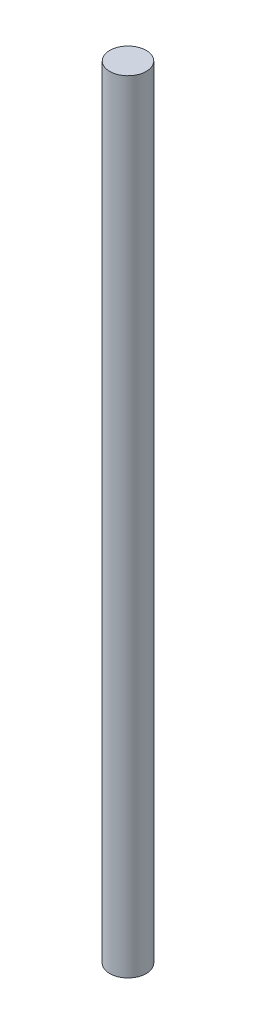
ISO-10303-21;
HEADER;
FILE_DESCRIPTION(('STEP AP214'),'2;1');
FILE_NAME('part.step','',(''),(''),'','','');
FILE_SCHEMA(('AUTOMOTIVE_DESIGN { 1 0 10303 214 1 1 1 1 }'));
ENDSEC;
DATA;
#1=APPLICATION_CONTEXT('core data for automotive mechanical design processes');
#2=APPLICATION_PROTOCOL_DEFINITION('international standard','automotive_design',2000,#1);
#3=PRODUCT_CONTEXT('',#1,'mechanical');
#4=PRODUCT('Part','Part','',(#3));
#5=PRODUCT_RELATED_PRODUCT_CATEGORY('part','',(#4));
#6=PRODUCT_DEFINITION_FORMATION('','',#4);
#7=PRODUCT_DEFINITION_CONTEXT('part definition',#1,'design');
#8=PRODUCT_DEFINITION('design','',#6,#7);
#9=PRODUCT_DEFINITION_SHAPE('','',#8);
#10=(LENGTH_UNIT() NAMED_UNIT(*) SI_UNIT(.MILLI.,.METRE.));
#11=(NAMED_UNIT(*) PLANE_ANGLE_UNIT() SI_UNIT($,.RADIAN.));
#12=(NAMED_UNIT(*) SI_UNIT($,.STERADIAN.) SOLID_ANGLE_UNIT());
#13=UNCERTAINTY_MEASURE_WITH_UNIT(LENGTH_MEASURE(1.E-05),#10,'distance_accuracy_value','');
#14=(GEOMETRIC_REPRESENTATION_CONTEXT(3) GLOBAL_UNCERTAINTY_ASSIGNED_CONTEXT((#13)) GLOBAL_UNIT_ASSIGNED_CONTEXT((#10,
#11,#12)) REPRESENTATION_CONTEXT('',''));
#15=CARTESIAN_POINT('',(0.,0.,0.));
#16=DIRECTION('',(0.,0.,1.));
#17=DIRECTION('',(1.,0.,0.));
#18=AXIS2_PLACEMENT_3D('',#15,#16,#17);
#19=CARTESIAN_POINT('',(-0.882259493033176,75.,-0.735216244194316));
#20=DIRECTION('',(0.,-1.,0.));
#21=DIRECTION('',(0.,0.,-1.));
#22=AXIS2_PLACEMENT_3D('',#19,#20,#21);
#23=CYLINDRICAL_SURFACE('',#22,1.75);
#24=CARTESIAN_POINT('',(-0.882259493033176,75.,-0.735216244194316));
#25=DIRECTION('',(0.,1.,0.));
#26=DIRECTION('',(0.,0.,1.));
#27=AXIS2_PLACEMENT_3D('',#24,#25,#26);
#28=CIRCLE('',#27,1.75);
#29=CARTESIAN_POINT('',(-0.882259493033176,75.,1.01478375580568));
#30=VERTEX_POINT('',#29);
#31=EDGE_CURVE('E10',#30,#30,#28,.T.);
#32=ORIENTED_EDGE('',*,*,#31,.F.);
#33=EDGE_LOOP('',(#32));
#34=FACE_BOUND('',#33,.T.);
#35=CARTESIAN_POINT('',(-0.882259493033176,0.,-0.735216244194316));
#36=DIRECTION('',(0.,1.,0.));
#37=DIRECTION('',(0.,0.,1.));
#38=AXIS2_PLACEMENT_3D('',#35,#36,#37);
#39=CIRCLE('',#38,1.75);
#40=CARTESIAN_POINT('',(-0.882259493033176,0.,1.01478375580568));
#41=VERTEX_POINT('',#40);
#42=EDGE_CURVE('E36',#41,#41,#39,.T.);
#43=ORIENTED_EDGE('',*,*,#42,.T.);
#44=EDGE_LOOP('',(#43));
#45=FACE_BOUND('',#44,.T.);
#46=ADVANCED_FACE('F33',(#34,#45),#23,.T.);
#47=CARTESIAN_POINT('',(-0.882259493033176,75.,-0.735216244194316));
#48=DIRECTION('',(0.,1.,0.));
#49=DIRECTION('',(0.,0.,1.));
#50=AXIS2_PLACEMENT_3D('',#47,#48,#49);
#51=PLANE('',#50);
#52=ORIENTED_EDGE('',*,*,#31,.T.);
#53=EDGE_LOOP('',(#52));
#54=FACE_BOUND('',#53,.T.);
#55=ADVANCED_FACE('F48',(#54),#51,.T.);
#56=CARTESIAN_POINT('',(-0.882259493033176,0.,-0.735216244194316));
#57=DIRECTION('',(0.,1.,0.));
#58=DIRECTION('',(0.,0.,1.));
#59=AXIS2_PLACEMENT_3D('',#56,#57,#58);
#60=PLANE('',#59);
#61=ORIENTED_EDGE('',*,*,#42,.F.);
#62=EDGE_LOOP('',(#61));
#63=FACE_BOUND('',#62,.T.);
#64=ADVANCED_FACE('F46',(#63),#60,.F.);
#65=CLOSED_SHELL('',(#46,#55,#64));
#66=MANIFOLD_SOLID_BREP('B2',#65);
#67=ADVANCED_BREP_SHAPE_REPRESENTATION('',(#18,#66),#14);
#68=SHAPE_DEFINITION_REPRESENTATION(#9,#67);
ENDSEC;
END-ISO-10303-21;
